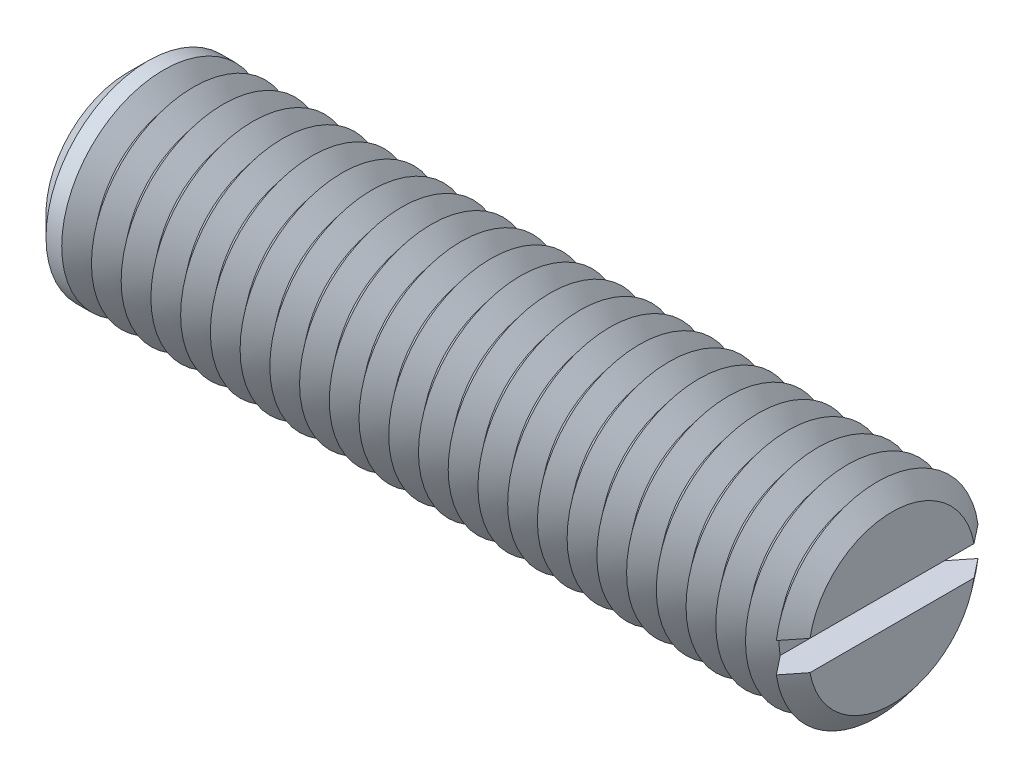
from build123d import *

# Parameters (mm, degrees)
SKETCH1_R       = 6
EXTRUDE1_DEPTH  = 22.5
SKETCH2_W       = 1.75
SKETCH2_H       = 1.75
EXTRUDE2_DEPTH  = 9
CHAMFER1_SIZE   = 1.2
LPATTERN1_COUNT = 25
LPATTERN1_PITCH = 1.75


with BuildPart() as part:
    # Sketch1 → Extrude1 (new, symmetric)
    with BuildSketch(Plane(origin=(0, 0, 0), x_dir=(0, 0, -1), z_dir=(1, 0, 0))):
        with Locations(Location((0, 0, 0), (0, 0, 180))):
            Circle(SKETCH1_R)
    extrude(amount=EXTRUDE1_DEPTH, both=True)

    # Sketch2 → Extrude2 (cut, symmetric)
    with BuildSketch(Plane.XY):
        with Locations((21.625, 0)):
            Rectangle(SKETCH2_W, SKETCH2_H)
    extrude(amount=EXTRUDE2_DEPTH, both=True, mode=Mode.SUBTRACT)

    # Chamfer1
    chamfer1_edges = [part.edges().sort_by_distance(p)[0] for p in [
        (-22.5, 0, -6),
    ]]
    chamfer(chamfer1_edges, length=CHAMFER1_SIZE)

    # Sketch3 → Cut-Revolve1 (revolve, cut)
    with BuildSketch(Plane.XY, mode=Mode.PRIVATE) as cut_revolve1_sk:
        Polygon((21.625, -6), (23.375, -6), (22.5, -4.90712535), align=None)
    cut_revolve1 = revolve(cut_revolve1_sk.sketch.rotate(Axis((0, 0, 0), (1, 0, 0)), 261.614461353), axis=Axis((0, 0, 0), (1, 0, 0)), mode=Mode.SUBTRACT)

    # LPattern1: Cut-Revolve1 ×25
    with Locations(*[(-i * LPATTERN1_PITCH, 0, 0) for i in range(1, LPATTERN1_COUNT)]):
        add(cut_revolve1, mode=Mode.SUBTRACT)


solid = part.part
